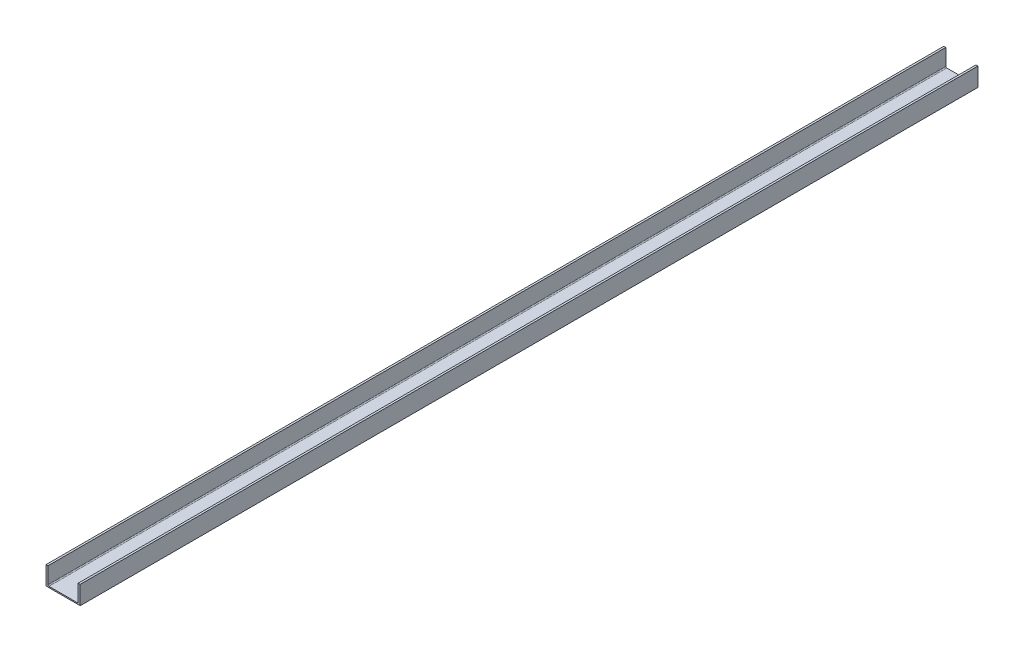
from build123d import *

# Parameters (mm, degrees)
BOSS_EXTRUDE1_DEPTH = 2000.18
FILLET1_R           = 4.445


with BuildPart() as part:
    # Sketch3 → Boss-Extrude1 (new, symmetric)
    with BuildSketch(Plane.XY):
        Polygon((-76.2, 41.275), (-76.2, -41.275), (76.2, -41.275), (76.2, 41.275), (67.31, 41.275), (67.31, -35.941), (-67.31, -35.941), (-67.31, 41.275), align=None)
    extrude(amount=BOSS_EXTRUDE1_DEPTH, both=True)

    # Fillet1
    fillet1_edges = [part.edges().sort_by_distance(p)[0] for p in [
        (-67.31, -35.941, 0),
        (67.31, -35.941, 0),
    ]]
    fillet(fillet1_edges, radius=FILLET1_R)


solid = part.part
